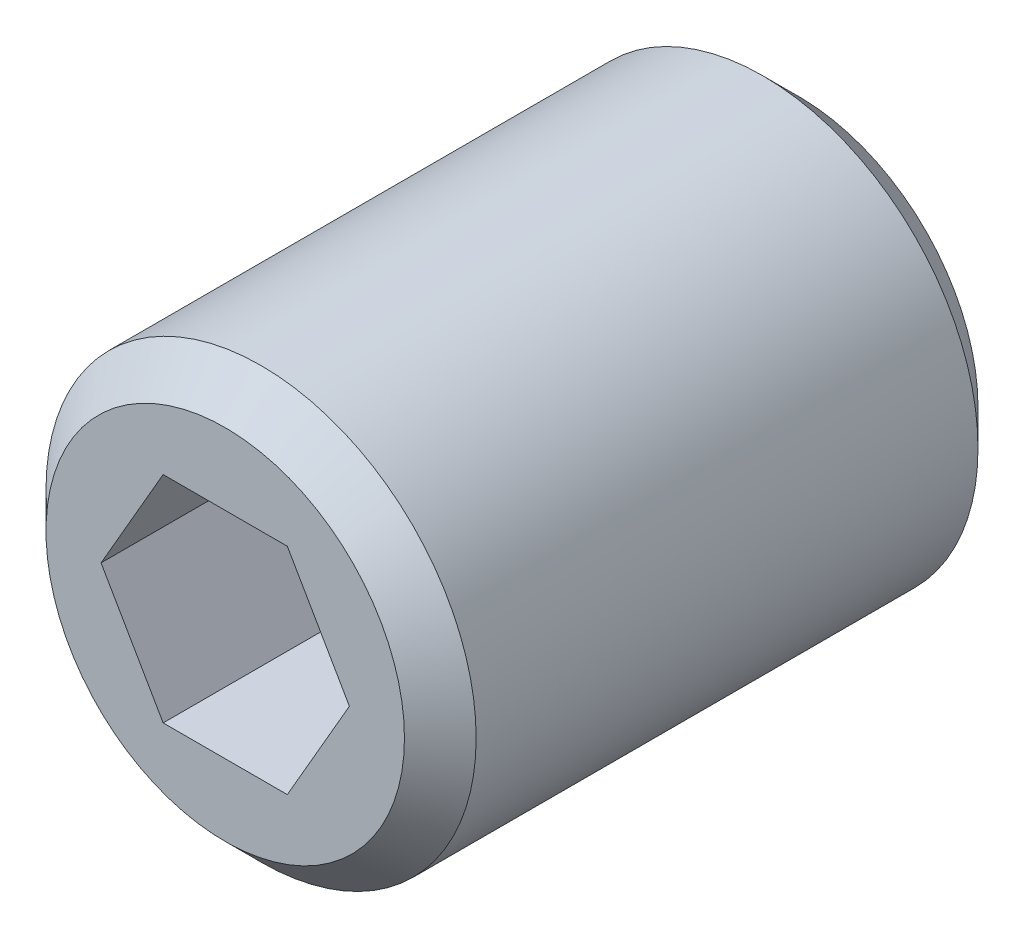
ISO-10303-21;
HEADER;
FILE_DESCRIPTION(('STEP AP214'),'2;1');
FILE_NAME('part.step','',(''),(''),'','','');
FILE_SCHEMA(('AUTOMOTIVE_DESIGN { 1 0 10303 214 1 1 1 1 }'));
ENDSEC;
DATA;
#1=APPLICATION_CONTEXT('core data for automotive mechanical design processes');
#2=APPLICATION_PROTOCOL_DEFINITION('international standard','automotive_design',2000,#1);
#3=PRODUCT_CONTEXT('',#1,'mechanical');
#4=PRODUCT('Part','Part','',(#3));
#5=PRODUCT_RELATED_PRODUCT_CATEGORY('part','',(#4));
#6=PRODUCT_DEFINITION_FORMATION('','',#4);
#7=PRODUCT_DEFINITION_CONTEXT('part definition',#1,'design');
#8=PRODUCT_DEFINITION('design','',#6,#7);
#9=PRODUCT_DEFINITION_SHAPE('','',#8);
#10=(LENGTH_UNIT() NAMED_UNIT(*) SI_UNIT(.MILLI.,.METRE.));
#11=(NAMED_UNIT(*) PLANE_ANGLE_UNIT() SI_UNIT($,.RADIAN.));
#12=(NAMED_UNIT(*) SI_UNIT($,.STERADIAN.) SOLID_ANGLE_UNIT());
#13=UNCERTAINTY_MEASURE_WITH_UNIT(LENGTH_MEASURE(1.E-05),#10,'distance_accuracy_value','');
#14=(GEOMETRIC_REPRESENTATION_CONTEXT(3) GLOBAL_UNCERTAINTY_ASSIGNED_CONTEXT((#13)) GLOBAL_UNIT_ASSIGNED_CONTEXT((#10,
#11,#12)) REPRESENTATION_CONTEXT('',''));
#15=CARTESIAN_POINT('',(0.,0.,0.));
#16=DIRECTION('',(0.,0.,1.));
#17=DIRECTION('',(1.,0.,0.));
#18=AXIS2_PLACEMENT_3D('',#15,#16,#17);
#19=CARTESIAN_POINT('',(0.,0.,8.));
#20=DIRECTION('',(0.,0.,1.));
#21=DIRECTION('',(1.,0.,0.));
#22=AXIS2_PLACEMENT_3D('',#19,#20,#21);
#23=PLANE('',#22);
#24=CARTESIAN_POINT('',(0.,0.,8.));
#25=DIRECTION('',(0.,0.,1.));
#26=DIRECTION('',(1.,0.,0.));
#27=AXIS2_PLACEMENT_3D('',#24,#25,#26);
#28=CIRCLE('',#27,2.49999999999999);
#29=CARTESIAN_POINT('',(2.49999999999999,0.,8.));
#30=VERTEX_POINT('',#29);
#31=EDGE_CURVE('E11',#30,#30,#28,.T.);
#32=ORIENTED_EDGE('',*,*,#31,.T.);
#33=EDGE_LOOP('',(#32));
#34=FACE_BOUND('',#33,.T.);
#35=DIRECTION('',(-0.5,0.866025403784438,0.));
#36=VECTOR('',#35,1.);
#37=CARTESIAN_POINT('',(-0.866025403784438,-1.5,8.));
#38=LINE('',#37,#36);
#39=CARTESIAN_POINT('',(-0.866025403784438,-1.5,8.));
#40=VERTEX_POINT('',#39);
#41=CARTESIAN_POINT('',(-1.73205080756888,0.,8.));
#42=VERTEX_POINT('',#41);
#43=EDGE_CURVE('E105',#40,#42,#38,.T.);
#44=ORIENTED_EDGE('',*,*,#43,.T.);
#45=DIRECTION('',(0.5,0.866025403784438,0.));
#46=VECTOR('',#45,1.);
#47=CARTESIAN_POINT('',(-1.73205080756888,0.,8.));
#48=LINE('',#47,#46);
#49=CARTESIAN_POINT('',(-0.866025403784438,1.5,8.));
#50=VERTEX_POINT('',#49);
#51=EDGE_CURVE('E46',#42,#50,#48,.T.);
#52=ORIENTED_EDGE('',*,*,#51,.T.);
#53=DIRECTION('',(1.,0.,0.));
#54=VECTOR('',#53,1.);
#55=CARTESIAN_POINT('',(-0.866025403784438,1.5,8.));
#56=LINE('',#55,#54);
#57=CARTESIAN_POINT('',(0.866025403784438,1.5,8.));
#58=VERTEX_POINT('',#57);
#59=EDGE_CURVE('E86',#50,#58,#56,.T.);
#60=ORIENTED_EDGE('',*,*,#59,.T.);
#61=DIRECTION('',(0.5,-0.866025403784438,0.));
#62=VECTOR('',#61,1.);
#63=CARTESIAN_POINT('',(0.866025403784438,1.5,8.));
#64=LINE('',#63,#62);
#65=CARTESIAN_POINT('',(1.73205080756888,0.,8.));
#66=VERTEX_POINT('',#65);
#67=EDGE_CURVE('E94',#58,#66,#64,.T.);
#68=ORIENTED_EDGE('',*,*,#67,.T.);
#69=DIRECTION('',(-0.5,-0.866025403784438,0.));
#70=VECTOR('',#69,1.);
#71=CARTESIAN_POINT('',(1.73205080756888,0.,8.));
#72=LINE('',#71,#70);
#73=CARTESIAN_POINT('',(0.866025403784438,-1.5,8.));
#74=VERTEX_POINT('',#73);
#75=EDGE_CURVE('E109',#66,#74,#72,.T.);
#76=ORIENTED_EDGE('',*,*,#75,.T.);
#77=DIRECTION('',(-1.,0.,0.));
#78=VECTOR('',#77,1.);
#79=CARTESIAN_POINT('',(0.866025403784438,-1.5,8.));
#80=LINE('',#79,#78);
#81=EDGE_CURVE('E112',#74,#40,#80,.T.);
#82=ORIENTED_EDGE('',*,*,#81,.T.);
#83=EDGE_LOOP('',(#44,#52,#60,#68,#76,#82));
#84=FACE_BOUND('',#83,.T.);
#85=ADVANCED_FACE('F31',(#34,#84),#23,.T.);
#86=CARTESIAN_POINT('',(0.,0.,8.));
#87=DIRECTION('',(0.,0.,-1.));
#88=DIRECTION('',(-1.,0.,0.));
#89=AXIS2_PLACEMENT_3D('',#86,#87,#88);
#90=CYLINDRICAL_SURFACE('',#89,3.);
#91=CARTESIAN_POINT('',(0.,0.,0.500000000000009));
#92=DIRECTION('',(0.,0.,1.));
#93=DIRECTION('',(1.,0.,0.));
#94=AXIS2_PLACEMENT_3D('',#91,#92,#93);
#95=CIRCLE('',#94,3.);
#96=CARTESIAN_POINT('',(3.,0.,0.500000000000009));
#97=VERTEX_POINT('',#96);
#98=EDGE_CURVE('E136',#97,#97,#95,.T.);
#99=ORIENTED_EDGE('',*,*,#98,.T.);
#100=EDGE_LOOP('',(#99));
#101=FACE_BOUND('',#100,.T.);
#102=CARTESIAN_POINT('',(0.,0.,7.5));
#103=DIRECTION('',(0.,0.,1.));
#104=DIRECTION('',(1.,0.,0.));
#105=AXIS2_PLACEMENT_3D('',#102,#103,#104);
#106=CIRCLE('',#105,3.);
#107=CARTESIAN_POINT('',(3.,0.,7.5));
#108=VERTEX_POINT('',#107);
#109=EDGE_CURVE('E100',#108,#108,#106,.F.);
#110=ORIENTED_EDGE('',*,*,#109,.T.);
#111=EDGE_LOOP('',(#110));
#112=FACE_BOUND('',#111,.T.);
#113=ADVANCED_FACE('F33',(#101,#112),#90,.T.);
#114=CARTESIAN_POINT('',(0.,0.,0.));
#115=DIRECTION('',(0.,0.,1.));
#116=DIRECTION('',(1.,0.,0.));
#117=AXIS2_PLACEMENT_3D('',#114,#115,#116);
#118=PLANE('',#117);
#119=CARTESIAN_POINT('',(0.,0.,0.));
#120=DIRECTION('',(0.,0.,1.));
#121=DIRECTION('',(1.,0.,0.));
#122=AXIS2_PLACEMENT_3D('',#119,#120,#121);
#123=CIRCLE('',#122,2.5);
#124=CARTESIAN_POINT('',(2.5,0.,0.));
#125=VERTEX_POINT('',#124);
#126=EDGE_CURVE('E39',#125,#125,#123,.F.);
#127=ORIENTED_EDGE('',*,*,#126,.T.);
#128=EDGE_LOOP('',(#127));
#129=FACE_BOUND('',#128,.T.);
#130=ADVANCED_FACE('F141',(#129),#118,.F.);
#131=CARTESIAN_POINT('',(-1.73205080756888,0.,4.3));
#132=DIRECTION('',(0.866025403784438,-0.5,0.));
#133=DIRECTION('',(0.5,0.866025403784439,0.));
#134=AXIS2_PLACEMENT_3D('',#131,#132,#133);
#135=PLANE('',#134);
#136=ORIENTED_EDGE('',*,*,#51,.F.);
#137=DIRECTION('',(0.,0.,1.));
#138=VECTOR('',#137,1.);
#139=CARTESIAN_POINT('',(-1.73205080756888,0.,4.3));
#140=LINE('',#139,#138);
#141=CARTESIAN_POINT('',(-1.73205080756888,0.,4.3));
#142=VERTEX_POINT('',#141);
#143=EDGE_CURVE('E125',#142,#42,#140,.T.);
#144=ORIENTED_EDGE('',*,*,#143,.F.);
#145=DIRECTION('',(0.5,0.866025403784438,0.));
#146=VECTOR('',#145,1.);
#147=CARTESIAN_POINT('',(-1.73205080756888,0.,4.3));
#148=LINE('',#147,#146);
#149=CARTESIAN_POINT('',(-0.866025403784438,1.5,4.3));
#150=VERTEX_POINT('',#149);
#151=EDGE_CURVE('E99',#142,#150,#148,.T.);
#152=ORIENTED_EDGE('',*,*,#151,.T.);
#153=DIRECTION('',(0.,0.,1.));
#154=VECTOR('',#153,1.);
#155=CARTESIAN_POINT('',(-0.866025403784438,1.5,4.3));
#156=LINE('',#155,#154);
#157=EDGE_CURVE('E88',#150,#50,#156,.T.);
#158=ORIENTED_EDGE('',*,*,#157,.T.);
#159=EDGE_LOOP('',(#136,#144,#152,#158));
#160=FACE_BOUND('',#159,.T.);
#161=ADVANCED_FACE('F97',(#160),#135,.T.);
#162=CARTESIAN_POINT('',(-0.866025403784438,1.5,4.3));
#163=DIRECTION('',(0.,-1.,0.));
#164=DIRECTION('',(1.,0.,0.));
#165=AXIS2_PLACEMENT_3D('',#162,#163,#164);
#166=PLANE('',#165);
#167=ORIENTED_EDGE('',*,*,#59,.F.);
#168=ORIENTED_EDGE('',*,*,#157,.F.);
#169=DIRECTION('',(1.,0.,0.));
#170=VECTOR('',#169,1.);
#171=CARTESIAN_POINT('',(-0.866025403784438,1.5,4.3));
#172=LINE('',#171,#170);
#173=CARTESIAN_POINT('',(0.866025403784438,1.5,4.3));
#174=VERTEX_POINT('',#173);
#175=EDGE_CURVE('E116',#150,#174,#172,.T.);
#176=ORIENTED_EDGE('',*,*,#175,.T.);
#177=DIRECTION('',(0.,0.,1.));
#178=VECTOR('',#177,1.);
#179=CARTESIAN_POINT('',(0.866025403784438,1.5,4.3));
#180=LINE('',#179,#178);
#181=EDGE_CURVE('E90',#174,#58,#180,.T.);
#182=ORIENTED_EDGE('',*,*,#181,.T.);
#183=EDGE_LOOP('',(#167,#168,#176,#182));
#184=FACE_BOUND('',#183,.T.);
#185=ADVANCED_FACE('F87',(#184),#166,.T.);
#186=CARTESIAN_POINT('',(0.866025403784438,1.5,4.3));
#187=DIRECTION('',(-0.866025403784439,-0.5,0.));
#188=DIRECTION('',(0.5,-0.866025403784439,0.));
#189=AXIS2_PLACEMENT_3D('',#186,#187,#188);
#190=PLANE('',#189);
#191=ORIENTED_EDGE('',*,*,#67,.F.);
#192=ORIENTED_EDGE('',*,*,#181,.F.);
#193=DIRECTION('',(0.5,-0.866025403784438,0.));
#194=VECTOR('',#193,1.);
#195=CARTESIAN_POINT('',(0.866025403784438,1.5,4.3));
#196=LINE('',#195,#194);
#197=CARTESIAN_POINT('',(1.73205080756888,0.,4.3));
#198=VERTEX_POINT('',#197);
#199=EDGE_CURVE('E118',#174,#198,#196,.T.);
#200=ORIENTED_EDGE('',*,*,#199,.T.);
#201=DIRECTION('',(0.,0.,1.));
#202=VECTOR('',#201,1.);
#203=CARTESIAN_POINT('',(1.73205080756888,0.,4.3));
#204=LINE('',#203,#202);
#205=EDGE_CURVE('E131',#198,#66,#204,.T.);
#206=ORIENTED_EDGE('',*,*,#205,.T.);
#207=EDGE_LOOP('',(#191,#192,#200,#206));
#208=FACE_BOUND('',#207,.T.);
#209=ADVANCED_FACE('F170',(#208),#190,.T.);
#210=CARTESIAN_POINT('',(1.73205080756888,0.,4.3));
#211=DIRECTION('',(-0.866025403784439,0.5,0.));
#212=DIRECTION('',(-0.5,-0.866025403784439,0.));
#213=AXIS2_PLACEMENT_3D('',#210,#211,#212);
#214=PLANE('',#213);
#215=ORIENTED_EDGE('',*,*,#75,.F.);
#216=ORIENTED_EDGE('',*,*,#205,.F.);
#217=DIRECTION('',(-0.5,-0.866025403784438,0.));
#218=VECTOR('',#217,1.);
#219=CARTESIAN_POINT('',(1.73205080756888,0.,4.3));
#220=LINE('',#219,#218);
#221=CARTESIAN_POINT('',(0.866025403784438,-1.5,4.3));
#222=VERTEX_POINT('',#221);
#223=EDGE_CURVE('E120',#198,#222,#220,.T.);
#224=ORIENTED_EDGE('',*,*,#223,.T.);
#225=DIRECTION('',(0.,0.,1.));
#226=VECTOR('',#225,1.);
#227=CARTESIAN_POINT('',(0.866025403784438,-1.5,4.3));
#228=LINE('',#227,#226);
#229=EDGE_CURVE('E129',#222,#74,#228,.T.);
#230=ORIENTED_EDGE('',*,*,#229,.T.);
#231=EDGE_LOOP('',(#215,#216,#224,#230));
#232=FACE_BOUND('',#231,.T.);
#233=ADVANCED_FACE('F173',(#232),#214,.T.);
#234=CARTESIAN_POINT('',(0.866025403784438,-1.5,4.3));
#235=DIRECTION('',(0.,1.,0.));
#236=DIRECTION('',(-1.,0.,0.));
#237=AXIS2_PLACEMENT_3D('',#234,#235,#236);
#238=PLANE('',#237);
#239=ORIENTED_EDGE('',*,*,#81,.F.);
#240=ORIENTED_EDGE('',*,*,#229,.F.);
#241=DIRECTION('',(-1.,0.,0.));
#242=VECTOR('',#241,1.);
#243=CARTESIAN_POINT('',(0.866025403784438,-1.5,4.3));
#244=LINE('',#243,#242);
#245=CARTESIAN_POINT('',(-0.866025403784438,-1.5,4.3));
#246=VERTEX_POINT('',#245);
#247=EDGE_CURVE('E122',#222,#246,#244,.T.);
#248=ORIENTED_EDGE('',*,*,#247,.T.);
#249=DIRECTION('',(0.,0.,1.));
#250=VECTOR('',#249,1.);
#251=CARTESIAN_POINT('',(-0.866025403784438,-1.5,4.3));
#252=LINE('',#251,#250);
#253=EDGE_CURVE('E127',#246,#40,#252,.T.);
#254=ORIENTED_EDGE('',*,*,#253,.T.);
#255=EDGE_LOOP('',(#239,#240,#248,#254));
#256=FACE_BOUND('',#255,.T.);
#257=ADVANCED_FACE('F177',(#256),#238,.T.);
#258=CARTESIAN_POINT('',(-0.866025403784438,-1.5,4.3));
#259=DIRECTION('',(0.866025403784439,0.5,0.));
#260=DIRECTION('',(-0.5,0.866025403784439,0.));
#261=AXIS2_PLACEMENT_3D('',#258,#259,#260);
#262=PLANE('',#261);
#263=ORIENTED_EDGE('',*,*,#43,.F.);
#264=ORIENTED_EDGE('',*,*,#253,.F.);
#265=DIRECTION('',(-0.5,0.866025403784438,0.));
#266=VECTOR('',#265,1.);
#267=CARTESIAN_POINT('',(-0.866025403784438,-1.5,4.3));
#268=LINE('',#267,#266);
#269=EDGE_CURVE('E53',#246,#142,#268,.T.);
#270=ORIENTED_EDGE('',*,*,#269,.T.);
#271=ORIENTED_EDGE('',*,*,#143,.T.);
#272=EDGE_LOOP('',(#263,#264,#270,#271));
#273=FACE_BOUND('',#272,.T.);
#274=ADVANCED_FACE('F181',(#273),#262,.T.);
#275=CARTESIAN_POINT('',(0.,3.,4.3));
#276=DIRECTION('',(0.,0.,-1.));
#277=DIRECTION('',(-1.,0.,0.));
#278=AXIS2_PLACEMENT_3D('',#275,#276,#277);
#279=PLANE('',#278);
#280=ORIENTED_EDGE('',*,*,#151,.F.);
#281=ORIENTED_EDGE('',*,*,#269,.F.);
#282=ORIENTED_EDGE('',*,*,#247,.F.);
#283=ORIENTED_EDGE('',*,*,#223,.F.);
#284=ORIENTED_EDGE('',*,*,#199,.F.);
#285=ORIENTED_EDGE('',*,*,#175,.F.);
#286=EDGE_LOOP('',(#280,#281,#282,#283,#284,#285));
#287=FACE_BOUND('',#286,.T.);
#288=ADVANCED_FACE('F147',(#287),#279,.F.);
#289=CARTESIAN_POINT('',(0.,0.,0.500000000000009));
#290=DIRECTION('',(0.,0.,1.));
#291=DIRECTION('',(1.,0.,0.));
#292=AXIS2_PLACEMENT_3D('',#289,#290,#291);
#293=CONICAL_SURFACE('',#292,3.,0.785398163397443);
#294=ORIENTED_EDGE('',*,*,#126,.F.);
#295=EDGE_LOOP('',(#294));
#296=FACE_BOUND('',#295,.T.);
#297=ORIENTED_EDGE('',*,*,#98,.F.);
#298=EDGE_LOOP('',(#297));
#299=FACE_BOUND('',#298,.T.);
#300=ADVANCED_FACE('F143',(#296,#299),#293,.T.);
#301=CARTESIAN_POINT('',(0.,0.,8.));
#302=DIRECTION('',(0.,0.,-1.));
#303=DIRECTION('',(-1.,0.,0.));
#304=AXIS2_PLACEMENT_3D('',#301,#302,#303);
#305=CONICAL_SURFACE('',#304,2.49999999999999,0.785398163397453);
#306=ORIENTED_EDGE('',*,*,#109,.F.);
#307=EDGE_LOOP('',(#306));
#308=FACE_BOUND('',#307,.T.);
#309=ORIENTED_EDGE('',*,*,#31,.F.);
#310=EDGE_LOOP('',(#309));
#311=FACE_BOUND('',#310,.T.);
#312=ADVANCED_FACE('F146',(#308,#311),#305,.T.);
#313=CLOSED_SHELL('',(#85,#113,#130,#161,#185,#209,#233,#257,#274,#288,#300,#312));
#314=MANIFOLD_SOLID_BREP('B2',#313);
#315=ADVANCED_BREP_SHAPE_REPRESENTATION('',(#18,#314),#14);
#316=SHAPE_DEFINITION_REPRESENTATION(#9,#315);
ENDSEC;
END-ISO-10303-21;
